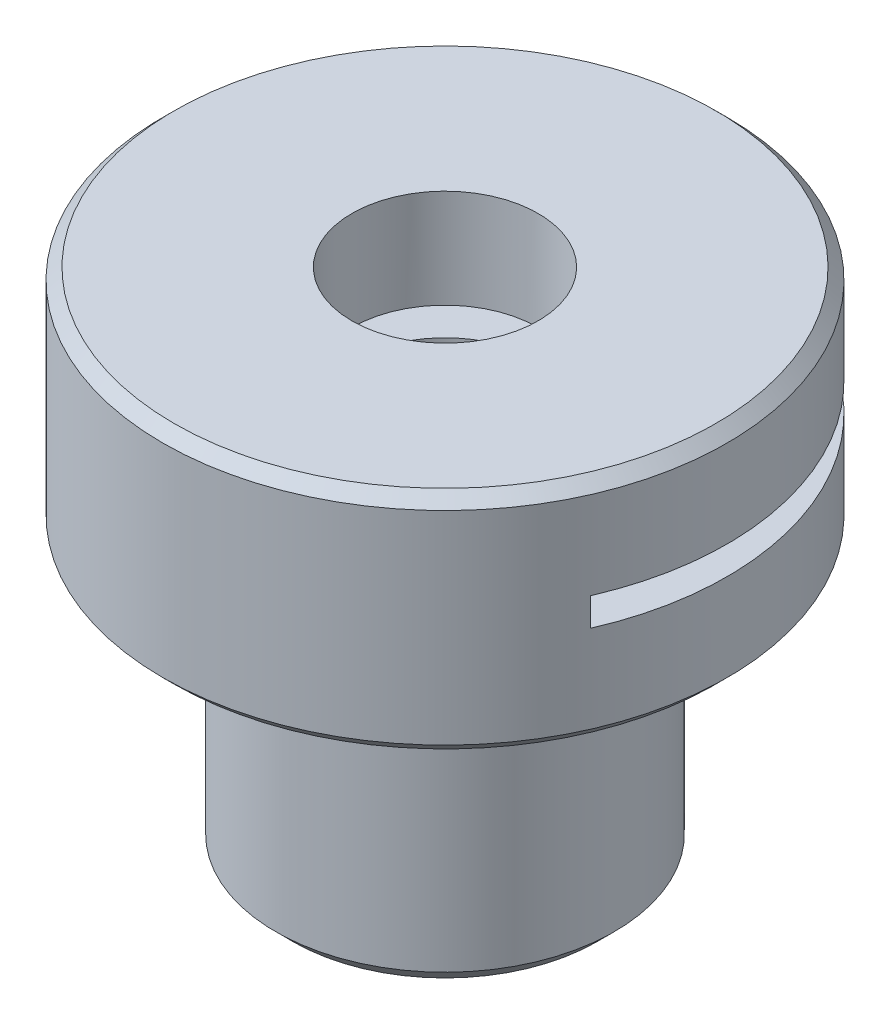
from build123d import *

# Parameters (mm, degrees)
SKETCH_2_R                      = 5
EXTRUDE_1_DEPTH                 = 4
SKETCH_6_R                      = 3
EXTRUDE_2_DEPTH                 = 5
HOLE_WIZARD_M4_2_D              = 3.3
CUT_EXTRUDE_1_REACH             = 10.66
SKETCH_9_W                      = 10
SKETCH_9_H                      = 0.5
CUT_EXTRUDE_1_DIRECTION_2_DEPTH = 2
CHAMFER_1_SIZE                  = 0.2
HOLE_WIZARD_M3_1_D              = 2.5
HOLE_WIZARD_M3_1_DEPTH          = 2.5
HOLE_WIZARD_M3_1_TIP            = 0.751075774
SKETCH_14_R                     = 3.382654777
SKETCH_14_R_2                   = 2.5
CUT_EXTRUDE_2_DEPTH             = 0.6
CHAMFER_2_SIZE                  = 0.3


with BuildPart() as part:
    # Sketch 2 → Extrude 1 (new body)
    with BuildSketch(Plane(origin=(0, 0, 0), x_dir=(1, 0, 0), z_dir=(0, 1, 0))):
        with Locations(Location((0, 0, 0), (0, 0, 270))):
            Circle(SKETCH_2_R)
    extrude(amount=EXTRUDE_1_DEPTH)

    # Sketch 6 → Extrude 2 (add)
    with BuildSketch(Plane.XZ):
        with Locations(Location((0, 0, 0), (0, 0, 270))):
            Circle(SKETCH_6_R)
    extrude(amount=EXTRUDE_2_DEPTH)

    # Hole Wizard M4 _2 (through all)
    with Locations(Plane(origin=(0, 4, 0), x_dir=(1, 0, 0), z_dir=(0, 1, 0))):
        with Locations((0, 0)):
            Hole(HOLE_WIZARD_M4_2_D / 2)

    # Sketch 9 → Cut-Extrude 1 (cut, up to next)
    with BuildSketch(Plane.XY, mode=Mode.PRIVATE) as cut_extrude_1_sk1:
        with Locations((0, 2)):
            Rectangle(SKETCH_9_W, SKETCH_9_H)
    cut_extrude_1_tool1 = extrude(cut_extrude_1_sk1.sketch, amount=-CUT_EXTRUDE_1_REACH, mode=Mode.PRIVATE) & part.part
    add(cut_extrude_1_tool1.solids().sort_by_distance((0, 2, 0))[0], mode=Mode.SUBTRACT)

    # Sketch 9 → Cut-Extrude 1 direction 2 (cut)
    with BuildSketch(Plane.XY):
        with Locations((0, 2)):
            Rectangle(SKETCH_9_W, SKETCH_9_H)
    extrude(amount=CUT_EXTRUDE_1_DIRECTION_2_DEPTH, mode=Mode.SUBTRACT)

    # Chamfer 1
    chamfer_1_edges = [part.edges().sort_by_distance(p)[0] for p in [
        (0, 0, -5),
        (0, 4, -5),
    ]]
    chamfer(chamfer_1_edges, length=CHAMFER_1_SIZE)

    # Hole Wizard M3 _1
    with Locations(Plane(origin=(0, 0, -5), x_dir=(-1, 0, 0), z_dir=(0, 0, -1))):
        with Locations((0, 2)):
            Hole(HOLE_WIZARD_M3_1_D / 2, depth=HOLE_WIZARD_M3_1_DEPTH)
            with Locations((0, 0, -(HOLE_WIZARD_M3_1_DEPTH + HOLE_WIZARD_M3_1_TIP / 2))):  # 118° drill point
                Cone(0, HOLE_WIZARD_M3_1_D / 2, HOLE_WIZARD_M3_1_TIP, mode=Mode.SUBTRACT)

    # Sketch 14 → Cut-Extrude 2 (cut)
    with BuildSketch(Plane.XZ):
        Circle(SKETCH_14_R)
        with Locations(Location((0, 0, 0), (0, 0, 270))):
            Circle(SKETCH_14_R_2, mode=Mode.SUBTRACT)
    extrude(amount=CUT_EXTRUDE_2_DEPTH, mode=Mode.SUBTRACT)

    # Chamfer 2
    chamfer_2_edges = [part.edges().sort_by_distance(p)[0] for p in [
        (0, -5, 3),
    ]]
    chamfer(chamfer_2_edges, length=CHAMFER_2_SIZE)


solid = part.part
